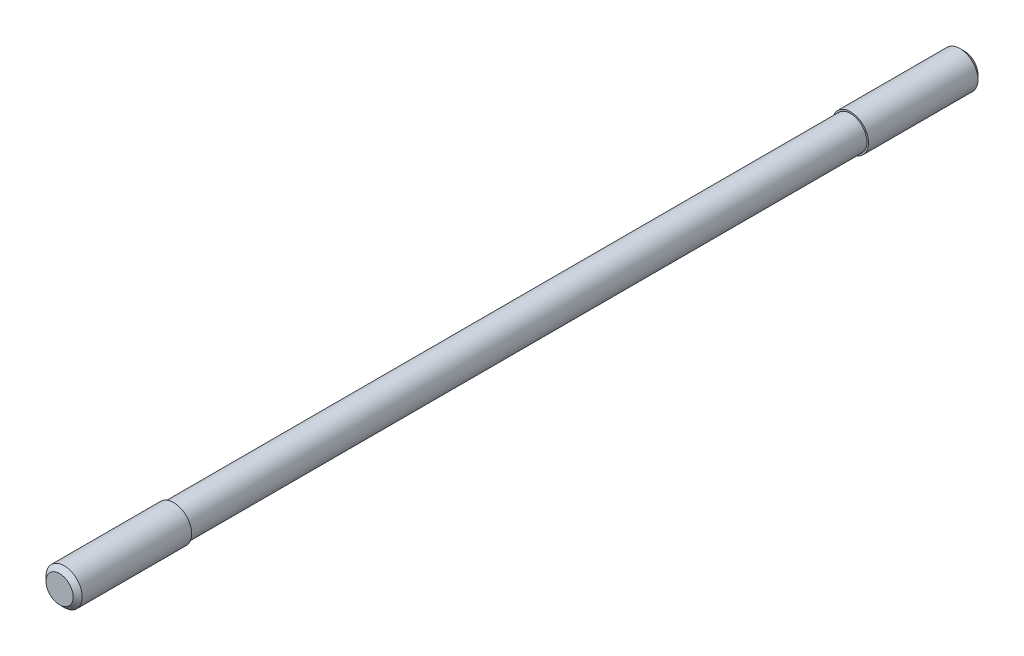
ISO-10303-21;
HEADER;
FILE_DESCRIPTION(('STEP AP214'),'2;1');
FILE_NAME('part.step','',(''),(''),'','','');
FILE_SCHEMA(('AUTOMOTIVE_DESIGN { 1 0 10303 214 1 1 1 1 }'));
ENDSEC;
DATA;
#1=APPLICATION_CONTEXT('core data for automotive mechanical design processes');
#2=APPLICATION_PROTOCOL_DEFINITION('international standard','automotive_design',2000,#1);
#3=PRODUCT_CONTEXT('',#1,'mechanical');
#4=PRODUCT('Part','Part','',(#3));
#5=PRODUCT_RELATED_PRODUCT_CATEGORY('part','',(#4));
#6=PRODUCT_DEFINITION_FORMATION('','',#4);
#7=PRODUCT_DEFINITION_CONTEXT('part definition',#1,'design');
#8=PRODUCT_DEFINITION('design','',#6,#7);
#9=PRODUCT_DEFINITION_SHAPE('','',#8);
#10=(LENGTH_UNIT() NAMED_UNIT(*) SI_UNIT(.MILLI.,.METRE.));
#11=(NAMED_UNIT(*) PLANE_ANGLE_UNIT() SI_UNIT($,.RADIAN.));
#12=(NAMED_UNIT(*) SI_UNIT($,.STERADIAN.) SOLID_ANGLE_UNIT());
#13=UNCERTAINTY_MEASURE_WITH_UNIT(LENGTH_MEASURE(1.E-05),#10,'distance_accuracy_value','');
#14=(GEOMETRIC_REPRESENTATION_CONTEXT(3) GLOBAL_UNCERTAINTY_ASSIGNED_CONTEXT((#13)) GLOBAL_UNIT_ASSIGNED_CONTEXT((#10,
#11,#12)) REPRESENTATION_CONTEXT('',''));
#15=CARTESIAN_POINT('',(0.,0.,0.));
#16=DIRECTION('',(0.,0.,1.));
#17=DIRECTION('',(1.,0.,0.));
#18=AXIS2_PLACEMENT_3D('',#15,#16,#17);
#19=CARTESIAN_POINT('',(0.,0.,0.));
#20=DIRECTION('',(0.,0.,1.));
#21=DIRECTION('',(1.,0.,0.));
#22=AXIS2_PLACEMENT_3D('',#19,#20,#21);
#23=PLANE('',#22);
#24=CARTESIAN_POINT('',(0.,0.,0.));
#25=DIRECTION('',(0.,0.,1.));
#26=DIRECTION('',(1.,0.,0.));
#27=AXIS2_PLACEMENT_3D('',#24,#25,#26);
#28=CIRCLE('',#27,7.5);
#29=CARTESIAN_POINT('',(7.5,0.,0.));
#30=VERTEX_POINT('',#29);
#31=EDGE_CURVE('E8',#30,#30,#28,.T.);
#32=ORIENTED_EDGE('',*,*,#31,.F.);
#33=EDGE_LOOP('',(#32));
#34=FACE_BOUND('',#33,.T.);
#35=ADVANCED_FACE('F12',(#34),#23,.F.);
#36=CARTESIAN_POINT('',(0.,0.,2.5));
#37=DIRECTION('',(0.,0.,1.));
#38=DIRECTION('',(1.,0.,0.));
#39=AXIS2_PLACEMENT_3D('',#36,#37,#38);
#40=CONICAL_SURFACE('',#39,10.,0.785398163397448);
#41=ORIENTED_EDGE('',*,*,#31,.T.);
#42=EDGE_LOOP('',(#41));
#43=FACE_BOUND('',#42,.T.);
#44=CARTESIAN_POINT('',(0.,0.,2.5));
#45=DIRECTION('',(0.,0.,1.));
#46=DIRECTION('',(1.,0.,0.));
#47=AXIS2_PLACEMENT_3D('',#44,#45,#46);
#48=CIRCLE('',#47,10.);
#49=CARTESIAN_POINT('',(10.,0.,2.5));
#50=VERTEX_POINT('',#49);
#51=EDGE_CURVE('E18',#50,#50,#48,.T.);
#52=ORIENTED_EDGE('',*,*,#51,.F.);
#53=EDGE_LOOP('',(#52));
#54=FACE_BOUND('',#53,.T.);
#55=ADVANCED_FACE('F61',(#43,#54),#40,.T.);
#56=CARTESIAN_POINT('',(0.,0.,70.));
#57=DIRECTION('',(0.,0.,1.));
#58=DIRECTION('',(1.,0.,0.));
#59=AXIS2_PLACEMENT_3D('',#56,#57,#58);
#60=CYLINDRICAL_SURFACE('',#59,10.);
#61=CARTESIAN_POINT('',(0.,0.,63.));
#62=DIRECTION('',(0.,0.,1.));
#63=DIRECTION('',(1.,0.,0.));
#64=AXIS2_PLACEMENT_3D('',#61,#62,#63);
#65=CIRCLE('',#64,10.);
#66=CARTESIAN_POINT('',(10.,0.,63.));
#67=VERTEX_POINT('',#66);
#68=EDGE_CURVE('E22',#67,#67,#65,.T.);
#69=ORIENTED_EDGE('',*,*,#68,.F.);
#70=EDGE_LOOP('',(#69));
#71=FACE_BOUND('',#70,.T.);
#72=ORIENTED_EDGE('',*,*,#51,.T.);
#73=EDGE_LOOP('',(#72));
#74=FACE_BOUND('',#73,.T.);
#75=ADVANCED_FACE('F66',(#71,#74),#60,.T.);
#76=CARTESIAN_POINT('',(10.,0.,63.));
#77=DIRECTION('',(0.,0.,-1.));
#78=DIRECTION('',(-1.,0.,0.));
#79=AXIS2_PLACEMENT_3D('',#76,#77,#78);
#80=PLANE('',#79);
#81=CARTESIAN_POINT('',(0.,0.,63.));
#82=DIRECTION('',(0.,0.,1.));
#83=DIRECTION('',(1.,0.,0.));
#84=AXIS2_PLACEMENT_3D('',#81,#82,#83);
#85=CIRCLE('',#84,9.15);
#86=CARTESIAN_POINT('',(9.15,0.,63.));
#87=VERTEX_POINT('',#86);
#88=EDGE_CURVE('E26',#87,#87,#85,.T.);
#89=ORIENTED_EDGE('',*,*,#88,.F.);
#90=EDGE_LOOP('',(#89));
#91=FACE_BOUND('',#90,.T.);
#92=ORIENTED_EDGE('',*,*,#68,.T.);
#93=EDGE_LOOP('',(#92));
#94=FACE_BOUND('',#93,.T.);
#95=ADVANCED_FACE('F70',(#91,#94),#80,.F.);
#96=CARTESIAN_POINT('',(0.,0.,70.));
#97=DIRECTION('',(0.,0.,1.));
#98=DIRECTION('',(1.,0.,0.));
#99=AXIS2_PLACEMENT_3D('',#96,#97,#98);
#100=CYLINDRICAL_SURFACE('',#99,9.15);
#101=CARTESIAN_POINT('',(0.,0.,437.));
#102=DIRECTION('',(0.,0.,1.));
#103=DIRECTION('',(1.,0.,0.));
#104=AXIS2_PLACEMENT_3D('',#101,#102,#103);
#105=CIRCLE('',#104,9.15);
#106=CARTESIAN_POINT('',(9.15,0.,437.));
#107=VERTEX_POINT('',#106);
#108=EDGE_CURVE('E31',#107,#107,#105,.T.);
#109=ORIENTED_EDGE('',*,*,#108,.F.);
#110=EDGE_LOOP('',(#109));
#111=FACE_BOUND('',#110,.T.);
#112=ORIENTED_EDGE('',*,*,#88,.T.);
#113=EDGE_LOOP('',(#112));
#114=FACE_BOUND('',#113,.T.);
#115=ADVANCED_FACE('F77',(#111,#114),#100,.T.);
#116=CARTESIAN_POINT('',(9.15,0.,437.));
#117=DIRECTION('',(0.,0.,1.));
#118=DIRECTION('',(1.,0.,0.));
#119=AXIS2_PLACEMENT_3D('',#116,#117,#118);
#120=PLANE('',#119);
#121=CARTESIAN_POINT('',(0.,0.,437.));
#122=DIRECTION('',(0.,0.,1.));
#123=DIRECTION('',(1.,0.,0.));
#124=AXIS2_PLACEMENT_3D('',#121,#122,#123);
#125=CIRCLE('',#124,10.);
#126=CARTESIAN_POINT('',(10.,0.,437.));
#127=VERTEX_POINT('',#126);
#128=EDGE_CURVE('E34',#127,#127,#125,.T.);
#129=ORIENTED_EDGE('',*,*,#128,.F.);
#130=EDGE_LOOP('',(#129));
#131=FACE_BOUND('',#130,.T.);
#132=ORIENTED_EDGE('',*,*,#108,.T.);
#133=EDGE_LOOP('',(#132));
#134=FACE_BOUND('',#133,.T.);
#135=ADVANCED_FACE('F57',(#131,#134),#120,.F.);
#136=CARTESIAN_POINT('',(0.,0.,70.));
#137=DIRECTION('',(0.,0.,1.));
#138=DIRECTION('',(1.,0.,0.));
#139=AXIS2_PLACEMENT_3D('',#136,#137,#138);
#140=CYLINDRICAL_SURFACE('',#139,10.);
#141=CARTESIAN_POINT('',(0.,0.,497.5));
#142=DIRECTION('',(0.,0.,1.));
#143=DIRECTION('',(1.,0.,0.));
#144=AXIS2_PLACEMENT_3D('',#141,#142,#143);
#145=CIRCLE('',#144,10.);
#146=CARTESIAN_POINT('',(10.,0.,497.5));
#147=VERTEX_POINT('',#146);
#148=EDGE_CURVE('E37',#147,#147,#145,.T.);
#149=ORIENTED_EDGE('',*,*,#148,.F.);
#150=EDGE_LOOP('',(#149));
#151=FACE_BOUND('',#150,.T.);
#152=ORIENTED_EDGE('',*,*,#128,.T.);
#153=EDGE_LOOP('',(#152));
#154=FACE_BOUND('',#153,.T.);
#155=ADVANCED_FACE('F48',(#151,#154),#140,.T.);
#156=CARTESIAN_POINT('',(0.,0.,500.));
#157=DIRECTION('',(0.,0.,-1.));
#158=DIRECTION('',(-1.,0.,0.));
#159=AXIS2_PLACEMENT_3D('',#156,#157,#158);
#160=CONICAL_SURFACE('',#159,7.5,0.785398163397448);
#161=ORIENTED_EDGE('',*,*,#148,.T.);
#162=EDGE_LOOP('',(#161));
#163=FACE_BOUND('',#162,.T.);
#164=CARTESIAN_POINT('',(0.,0.,500.));
#165=DIRECTION('',(0.,0.,1.));
#166=DIRECTION('',(1.,0.,0.));
#167=AXIS2_PLACEMENT_3D('',#164,#165,#166);
#168=CIRCLE('',#167,7.5);
#169=CARTESIAN_POINT('',(7.5,0.,500.));
#170=VERTEX_POINT('',#169);
#171=EDGE_CURVE('E40',#170,#170,#168,.T.);
#172=ORIENTED_EDGE('',*,*,#171,.F.);
#173=EDGE_LOOP('',(#172));
#174=FACE_BOUND('',#173,.T.);
#175=ADVANCED_FACE('F46',(#163,#174),#160,.T.);
#176=CARTESIAN_POINT('',(7.5,0.,500.));
#177=DIRECTION('',(0.,0.,-1.));
#178=DIRECTION('',(-1.,0.,0.));
#179=AXIS2_PLACEMENT_3D('',#176,#177,#178);
#180=PLANE('',#179);
#181=ORIENTED_EDGE('',*,*,#171,.T.);
#182=EDGE_LOOP('',(#181));
#183=FACE_BOUND('',#182,.T.);
#184=ADVANCED_FACE('F44',(#183),#180,.F.);
#185=CLOSED_SHELL('',(#35,#55,#75,#95,#115,#135,#155,#175,#184));
#186=MANIFOLD_SOLID_BREP('B1',#185);
#187=ADVANCED_BREP_SHAPE_REPRESENTATION('',(#18,#186),#14);
#188=SHAPE_DEFINITION_REPRESENTATION(#9,#187);
ENDSEC;
END-ISO-10303-21;
